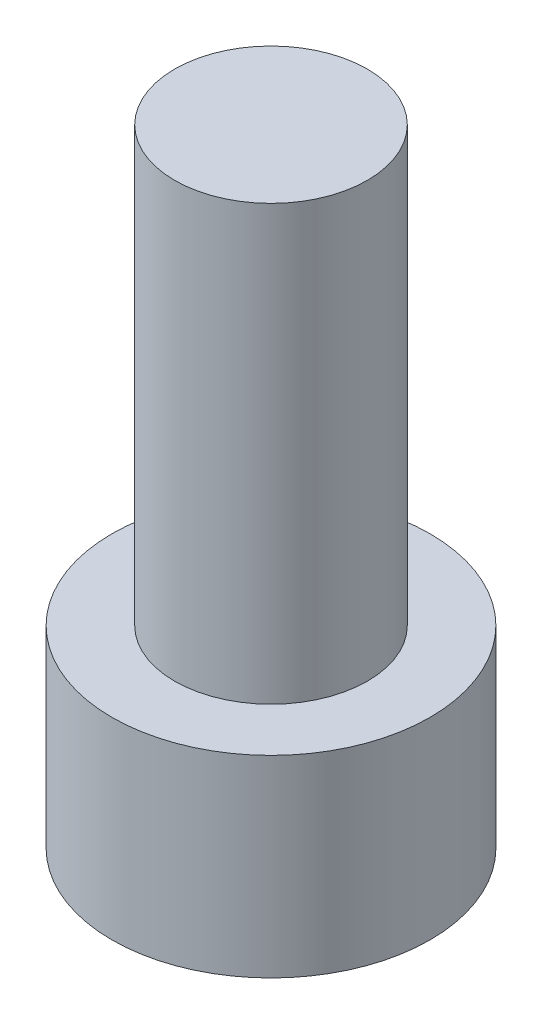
from build123d import *

# Parameters (mm, degrees)
SKETCH_1_R          = 6.6
EXTRUDE_1_DEPTH     = 8
SKETCH_2_R          = 4
EXTRUDE_2_DEPTH     = 18
CUT_EXTRUDE_1_DEPTH = 4


with BuildPart() as part:
    # Sketch 1 → Extrude 1 (new body)
    with BuildSketch(Plane(origin=(0, 0, 0), x_dir=(1, 0, 0), z_dir=(0, 1, 0))):
        with Locations(Location((0, 0, 0), (0, 0, 270))):
            Circle(SKETCH_1_R)
    extrude(amount=EXTRUDE_1_DEPTH)

    # Sketch 2 → Extrude 2 (add)
    with BuildSketch(Plane(origin=(0, 8, 0), x_dir=(1, 0, 0), z_dir=(0, 1, 0))):
        with Locations(Location((0, 0, 0), (0, 0, 270))):
            Circle(SKETCH_2_R)
    extrude(amount=EXTRUDE_2_DEPTH)

    # Sketch 3 → Cut-Extrude 1 (cut)
    with BuildSketch(Plane.XZ):
        Polygon((3.46061635, 0.155352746), (1.59576875, 3.074658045), (-1.8648476, 2.919305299), (-3.46061635, -0.155352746), (-1.59576875, -3.074658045), (1.8648476, -2.919305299), align=None)
    extrude(amount=-CUT_EXTRUDE_1_DEPTH, mode=Mode.SUBTRACT)


solid = part.part
